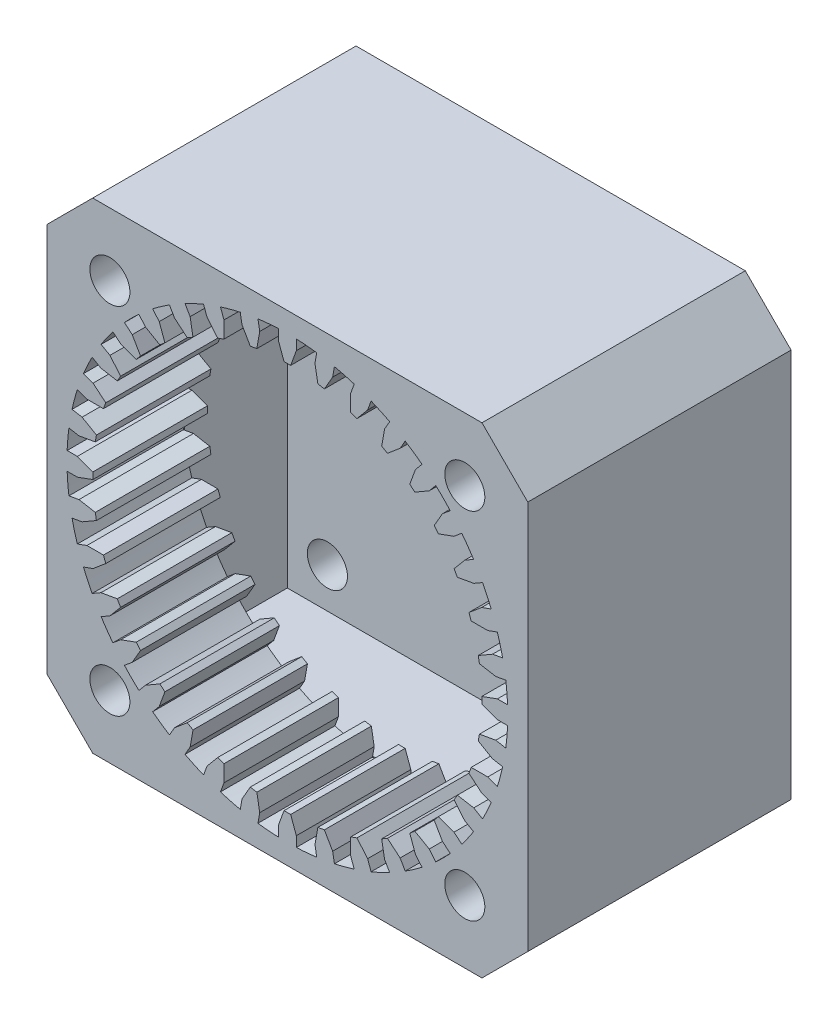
from build123d import *

# Parameters (mm, degrees)
SCHIZZO1_W                   = 42
SCHIZZO1_H                   = 42
ESTRUSIONE_ESTRUSIONE1_DEPTH = 13
SCHIZZO2_W                   = 38
SCHIZZO2_H                   = 38
TAGLIO_ESTRUSIONE1_DEPTH     = 9
SCHIZZO3_R                   = 1.75
TAGLIO_ESTRUSIONE2_DEPTH     = 32.032241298
SCHIZZO4_W                   = 42
SCHIZZO4_H                   = 42
ESTRUSIONE_ESTRUSIONE2_DEPTH = 10
SCHIZZO5_R                   = 2.75
SCHIZZO5_R_2                 = 1.75
TAGLIO_ESTRUSIONE3_DEPTH     = 38.563279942
SCHIZZO7_R                   = 11
TAGLIO_ESTRUSIONE4_DEPTH     = 3
SMUSSO1_SIZE                 = 4


with BuildPart() as part:
    # Schizzo1 → Estrusione-Estrusione1 (new body)
    with BuildSketch(Plane.XY):
        Rectangle(SCHIZZO1_W, SCHIZZO1_H)
    extrude(amount=ESTRUSIONE_ESTRUSIONE1_DEPTH)

    # Schizzo2 → Taglio-Estrusione1 (cut)
    with BuildSketch(Plane.XY.offset(13)):
        Rectangle(SCHIZZO2_W, SCHIZZO2_H)
    extrude(amount=-TAGLIO_ESTRUSIONE1_DEPTH, mode=Mode.SUBTRACT)

    # Schizzo3 → Taglio-Estrusione2 (cut, through all)
    with BuildSketch(Plane.XY.offset(4)):
        with Locations((-15.5, 15.5)):
            Circle(SCHIZZO3_R)
        with Locations((15.5, 15.5)):
            Circle(SCHIZZO3_R)
        with Locations((15.5, -15.5)):
            Circle(SCHIZZO3_R)
        with Locations((-15.5, -15.5)):
            Circle(SCHIZZO3_R)
    extrude(amount=-TAGLIO_ESTRUSIONE2_DEPTH, mode=Mode.SUBTRACT)

    # Schizzo4 → Estrusione-Estrusione2 (add)
    with BuildSketch(Plane.XY.offset(13)):
        Rectangle(SCHIZZO4_W, SCHIZZO4_H)
        with BuildLine():
            Line((19.233987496, 0.785), (18.343987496, 0.785))
            Line((18.343987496, 0.785), (16.983987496, 0.290000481))
            Line((16.983987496, 0.290000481), (16.983987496, -0.290000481))
            Line((16.983987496, -0.290000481), (18.343987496, -0.785))
            Line((18.343987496, -0.785), (19.233987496, -0.785))
            ThreePointArc((19.233987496, -0.785), (19.176747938, -1.677748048), (19.078093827, -2.566872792))
            Line((19.078093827, -2.566872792), (18.201614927, -2.412325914))
            Line((18.201614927, -2.412325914), (16.776320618, -2.663643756))
            Line((16.776320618, -2.663643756), (16.675604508, -3.234833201))
            Line((16.675604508, -3.234833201), (17.928987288, -3.958474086))
            Line((17.928987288, -3.958474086), (18.805466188, -4.113020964))
            ThreePointArc((18.805466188, -4.113020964), (18.594072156, -4.982266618), (18.342521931, -5.840752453))
            Line((18.342521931, -5.840752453), (17.506195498, -5.536354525))
            Line((17.506195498, -5.536354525), (16.058913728, -5.536354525))
            Line((16.058913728, -5.536354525), (15.860541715, -6.08137715))
            Line((15.860541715, -6.08137715), (16.969223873, -7.01167194))
            Line((16.969223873, -7.01167194), (17.805550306, -7.316069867))
            ThreePointArc((17.805550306, -7.316069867), (17.4464249, -8.135401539), (17.049621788, -8.937163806))
            Line((17.049621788, -8.937163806), (16.278859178, -8.492163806))
            Line((16.278859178, -8.492163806), (14.85356487, -8.240845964))
            Line((14.85356487, -8.240845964), (14.563564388, -8.743141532))
            Line((14.563564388, -8.743141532), (15.493859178, -9.85182369))
            Line((15.493859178, -9.85182369), (16.264621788, -10.29682369))
            ThreePointArc((16.264621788, -10.29682369), (15.768676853, -11.0413464), (15.238677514, -11.76202396))
            Line((15.238677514, -11.76202396), (14.55689796, -11.189942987))
            Line((14.55689796, -11.189942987), (13.19689796, -10.694943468))
            Line((13.19689796, -10.694943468), (12.824080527, -11.139249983))
            Line((12.824080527, -11.139249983), (13.547721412, -12.392632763))
            Line((13.547721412, -12.392632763), (14.229500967, -12.964713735))
            ThreePointArc((14.229500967, -12.964713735), (13.611805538, -13.611805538), (12.964713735, -14.229500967))
            Line((12.964713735, -14.229500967), (12.392632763, -13.547721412))
            Line((12.392632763, -13.547721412), (11.139249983, -12.824080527))
            Line((11.139249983, -12.824080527), (10.694943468, -13.19689796))
            Line((10.694943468, -13.19689796), (11.189942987, -14.55689796))
            Line((11.189942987, -14.55689796), (11.76202396, -15.238677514))
            ThreePointArc((11.76202396, -15.238677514), (11.0413464, -15.768676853), (10.29682369, -16.264621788))
            Line((10.29682369, -16.264621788), (9.85182369, -15.493859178))
            Line((9.85182369, -15.493859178), (8.743141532, -14.563564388))
            Line((8.743141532, -14.563564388), (8.240845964, -14.85356487))
            Line((8.240845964, -14.85356487), (8.492163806, -16.278859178))
            Line((8.492163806, -16.278859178), (8.937163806, -17.049621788))
            ThreePointArc((8.937163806, -17.049621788), (8.135401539, -17.4464249), (7.316069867, -17.805550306))
            Line((7.316069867, -17.805550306), (7.01167194, -16.969223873))
            Line((7.01167194, -16.969223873), (6.08137715, -15.860541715))
            Line((6.08137715, -15.860541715), (5.536354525, -16.058913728))
            Line((5.536354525, -16.058913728), (5.536354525, -17.506195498))
            Line((5.536354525, -17.506195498), (5.840752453, -18.342521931))
            ThreePointArc((5.840752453, -18.342521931), (4.982266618, -18.594072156), (4.113020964, -18.805466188))
            Line((4.113020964, -18.805466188), (3.958474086, -17.928987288))
            Line((3.958474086, -17.928987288), (3.234833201, -16.675604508))
            Line((3.234833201, -16.675604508), (2.663643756, -16.776320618))
            Line((2.663643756, -16.776320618), (2.412325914, -18.201614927))
            Line((2.412325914, -18.201614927), (2.566872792, -19.078093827))
            ThreePointArc((2.566872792, -19.078093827), (1.677748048, -19.176747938), (0.785, -19.233987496))
            Line((0.785, -19.233987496), (0.785, -18.343987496))
            Line((0.785, -18.343987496), (0.290000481, -16.983987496))
            Line((0.290000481, -16.983987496), (-0.290000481, -16.983987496))
            Line((-0.290000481, -16.983987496), (-0.785, -18.343987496))
            Line((-0.785, -18.343987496), (-0.785, -19.233987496))
            ThreePointArc((-0.785, -19.233987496), (-1.677748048, -19.176747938), (-2.566872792, -19.078093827))
            Line((-2.566872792, -19.078093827), (-2.412325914, -18.201614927))
            Line((-2.412325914, -18.201614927), (-2.663643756, -16.776320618))
            Line((-2.663643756, -16.776320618), (-3.234833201, -16.675604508))
            Line((-3.234833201, -16.675604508), (-3.958474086, -17.928987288))
            Line((-3.958474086, -17.928987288), (-4.113020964, -18.805466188))
            ThreePointArc((-4.113020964, -18.805466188), (-4.982266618, -18.594072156), (-5.840752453, -18.342521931))
            Line((-5.840752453, -18.342521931), (-5.536354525, -17.506195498))
            Line((-5.536354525, -17.506195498), (-5.536354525, -16.058913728))
            Line((-5.536354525, -16.058913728), (-6.08137715, -15.860541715))
            Line((-6.08137715, -15.860541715), (-7.01167194, -16.969223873))
            Line((-7.01167194, -16.969223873), (-7.316069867, -17.805550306))
            ThreePointArc((-7.316069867, -17.805550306), (-8.135401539, -17.4464249), (-8.937163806, -17.049621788))
            Line((-8.937163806, -17.049621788), (-8.492163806, -16.278859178))
            Line((-8.492163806, -16.278859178), (-8.240845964, -14.85356487))
            Line((-8.240845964, -14.85356487), (-8.743141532, -14.563564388))
            Line((-8.743141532, -14.563564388), (-9.85182369, -15.493859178))
            Line((-9.85182369, -15.493859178), (-10.29682369, -16.264621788))
            ThreePointArc((-10.29682369, -16.264621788), (-11.0413464, -15.768676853), (-11.76202396, -15.238677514))
            Line((-11.76202396, -15.238677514), (-11.189942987, -14.55689796))
            Line((-11.189942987, -14.55689796), (-10.694943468, -13.19689796))
            Line((-10.694943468, -13.19689796), (-11.139249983, -12.824080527))
            Line((-11.139249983, -12.824080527), (-12.392632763, -13.547721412))
            Line((-12.392632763, -13.547721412), (-12.964713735, -14.229500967))
            ThreePointArc((-12.964713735, -14.229500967), (-13.611805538, -13.611805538), (-14.229500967, -12.964713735))
            Line((-14.229500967, -12.964713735), (-13.547721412, -12.392632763))
            Line((-13.547721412, -12.392632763), (-12.824080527, -11.139249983))
            Line((-12.824080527, -11.139249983), (-13.19689796, -10.694943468))
            Line((-13.19689796, -10.694943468), (-14.55689796, -11.189942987))
            Line((-14.55689796, -11.189942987), (-15.238677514, -11.76202396))
            ThreePointArc((-15.238677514, -11.76202396), (-15.768676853, -11.0413464), (-16.264621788, -10.29682369))
            Line((-16.264621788, -10.29682369), (-15.493859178, -9.85182369))
            Line((-15.493859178, -9.85182369), (-14.563564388, -8.743141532))
            Line((-14.563564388, -8.743141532), (-14.85356487, -8.240845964))
            Line((-14.85356487, -8.240845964), (-16.278859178, -8.492163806))
            Line((-16.278859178, -8.492163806), (-17.049621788, -8.937163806))
            ThreePointArc((-17.049621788, -8.937163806), (-17.4464249, -8.135401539), (-17.805550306, -7.316069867))
            Line((-17.805550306, -7.316069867), (-16.969223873, -7.01167194))
            Line((-16.969223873, -7.01167194), (-15.860541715, -6.08137715))
            Line((-15.860541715, -6.08137715), (-16.058913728, -5.536354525))
            Line((-16.058913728, -5.536354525), (-17.506195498, -5.536354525))
            Line((-17.506195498, -5.536354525), (-18.342521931, -5.840752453))
            ThreePointArc((-18.342521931, -5.840752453), (-18.594072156, -4.982266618), (-18.805466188, -4.113020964))
            Line((-18.805466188, -4.113020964), (-17.928987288, -3.958474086))
            Line((-17.928987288, -3.958474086), (-16.675604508, -3.234833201))
            Line((-16.675604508, -3.234833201), (-16.776320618, -2.663643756))
            Line((-16.776320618, -2.663643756), (-18.201614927, -2.412325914))
            Line((-18.201614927, -2.412325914), (-19.078093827, -2.566872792))
            ThreePointArc((-19.078093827, -2.566872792), (-19.176747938, -1.677748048), (-19.233987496, -0.785))
            Line((-19.233987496, -0.785), (-18.343987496, -0.785))
            Line((-18.343987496, -0.785), (-16.983987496, -0.290000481))
            Line((-16.983987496, -0.290000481), (-16.983987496, 0.290000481))
            Line((-16.983987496, 0.290000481), (-18.343987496, 0.785))
            Line((-18.343987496, 0.785), (-19.233987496, 0.785))
            ThreePointArc((-19.233987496, 0.785), (-19.176747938, 1.677748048), (-19.078093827, 2.566872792))
            Line((-19.078093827, 2.566872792), (-18.201614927, 2.412325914))
            Line((-18.201614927, 2.412325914), (-16.776320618, 2.663643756))
            Line((-16.776320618, 2.663643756), (-16.675604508, 3.234833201))
            Line((-16.675604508, 3.234833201), (-17.928987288, 3.958474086))
            Line((-17.928987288, 3.958474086), (-18.805466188, 4.113020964))
            ThreePointArc((-18.805466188, 4.113020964), (-18.594072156, 4.982266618), (-18.342521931, 5.840752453))
            Line((-18.342521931, 5.840752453), (-17.506195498, 5.536354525))
            Line((-17.506195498, 5.536354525), (-16.058913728, 5.536354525))
            Line((-16.058913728, 5.536354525), (-15.860541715, 6.08137715))
            Line((-15.860541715, 6.08137715), (-16.969223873, 7.01167194))
            Line((-16.969223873, 7.01167194), (-17.805550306, 7.316069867))
            ThreePointArc((-17.805550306, 7.316069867), (-17.4464249, 8.135401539), (-17.049621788, 8.937163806))
            Line((-17.049621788, 8.937163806), (-16.278859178, 8.492163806))
            Line((-16.278859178, 8.492163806), (-14.85356487, 8.240845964))
            Line((-14.85356487, 8.240845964), (-14.563564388, 8.743141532))
            Line((-14.563564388, 8.743141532), (-15.493859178, 9.85182369))
            Line((-15.493859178, 9.85182369), (-16.264621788, 10.29682369))
            ThreePointArc((-16.264621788, 10.29682369), (-15.768676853, 11.0413464), (-15.238677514, 11.76202396))
            Line((-15.238677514, 11.76202396), (-14.55689796, 11.189942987))
            Line((-14.55689796, 11.189942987), (-13.19689796, 10.694943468))
            Line((-13.19689796, 10.694943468), (-12.824080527, 11.139249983))
            Line((-12.824080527, 11.139249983), (-13.547721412, 12.392632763))
            Line((-13.547721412, 12.392632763), (-14.229500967, 12.964713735))
            ThreePointArc((-14.229500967, 12.964713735), (-13.611805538, 13.611805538), (-12.964713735, 14.229500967))
            Line((-12.964713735, 14.229500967), (-12.392632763, 13.547721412))
            Line((-12.392632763, 13.547721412), (-11.139249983, 12.824080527))
            Line((-11.139249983, 12.824080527), (-10.694943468, 13.19689796))
            Line((-10.694943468, 13.19689796), (-11.189942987, 14.55689796))
            Line((-11.189942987, 14.55689796), (-11.76202396, 15.238677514))
            ThreePointArc((-11.76202396, 15.238677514), (-11.0413464, 15.768676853), (-10.29682369, 16.264621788))
            Line((-10.29682369, 16.264621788), (-9.85182369, 15.493859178))
            Line((-9.85182369, 15.493859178), (-8.743141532, 14.563564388))
            Line((-8.743141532, 14.563564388), (-8.240845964, 14.85356487))
            Line((-8.240845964, 14.85356487), (-8.492163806, 16.278859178))
            Line((-8.492163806, 16.278859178), (-8.937163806, 17.049621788))
            ThreePointArc((-8.937163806, 17.049621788), (-8.135401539, 17.4464249), (-7.316069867, 17.805550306))
            Line((-7.316069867, 17.805550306), (-7.01167194, 16.969223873))
            Line((-7.01167194, 16.969223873), (-6.08137715, 15.860541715))
            Line((-6.08137715, 15.860541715), (-5.536354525, 16.058913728))
            Line((-5.536354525, 16.058913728), (-5.536354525, 17.506195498))
            Line((-5.536354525, 17.506195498), (-5.840752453, 18.342521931))
            ThreePointArc((-5.840752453, 18.342521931), (-4.982266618, 18.594072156), (-4.113020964, 18.805466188))
            Line((-4.113020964, 18.805466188), (-3.958474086, 17.928987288))
            Line((-3.958474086, 17.928987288), (-3.234833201, 16.675604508))
            Line((-3.234833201, 16.675604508), (-2.663643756, 16.776320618))
            Line((-2.663643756, 16.776320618), (-2.412325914, 18.201614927))
            Line((-2.412325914, 18.201614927), (-2.566872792, 19.078093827))
            ThreePointArc((-2.566872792, 19.078093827), (-1.677748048, 19.176747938), (-0.785, 19.233987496))
            Line((-0.785, 19.233987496), (-0.785, 18.343987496))
            Line((-0.785, 18.343987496), (-0.290000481, 16.983987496))
            Line((-0.290000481, 16.983987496), (0.290000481, 16.983987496))
            Line((0.290000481, 16.983987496), (0.785, 18.343987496))
            Line((0.785, 18.343987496), (0.785, 19.233987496))
            ThreePointArc((0.785, 19.233987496), (1.677748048, 19.176747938), (2.566872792, 19.078093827))
            Line((2.566872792, 19.078093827), (2.412325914, 18.201614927))
            Line((2.412325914, 18.201614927), (2.663643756, 16.776320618))
            Line((2.663643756, 16.776320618), (3.234833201, 16.675604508))
            Line((3.234833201, 16.675604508), (3.958474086, 17.928987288))
            Line((3.958474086, 17.928987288), (4.113020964, 18.805466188))
            ThreePointArc((4.113020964, 18.805466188), (4.982266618, 18.594072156), (5.840752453, 18.342521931))
            Line((5.840752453, 18.342521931), (5.536354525, 17.506195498))
            Line((5.536354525, 17.506195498), (5.536354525, 16.058913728))
            Line((5.536354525, 16.058913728), (6.08137715, 15.860541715))
            Line((6.08137715, 15.860541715), (7.01167194, 16.969223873))
            Line((7.01167194, 16.969223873), (7.316069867, 17.805550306))
            ThreePointArc((7.316069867, 17.805550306), (8.135401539, 17.4464249), (8.937163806, 17.049621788))
            Line((8.937163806, 17.049621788), (8.492163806, 16.278859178))
            Line((8.492163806, 16.278859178), (8.240845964, 14.85356487))
            Line((8.240845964, 14.85356487), (8.743141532, 14.563564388))
            Line((8.743141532, 14.563564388), (9.85182369, 15.493859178))
            Line((9.85182369, 15.493859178), (10.29682369, 16.264621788))
            ThreePointArc((10.29682369, 16.264621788), (11.0413464, 15.768676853), (11.76202396, 15.238677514))
            Line((11.76202396, 15.238677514), (11.189942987, 14.55689796))
            Line((11.189942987, 14.55689796), (10.694943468, 13.19689796))
            Line((10.694943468, 13.19689796), (11.139249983, 12.824080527))
            Line((11.139249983, 12.824080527), (12.392632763, 13.547721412))
            Line((12.392632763, 13.547721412), (12.964713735, 14.229500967))
            ThreePointArc((12.964713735, 14.229500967), (13.611805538, 13.611805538), (14.229500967, 12.964713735))
            Line((14.229500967, 12.964713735), (13.547721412, 12.392632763))
            Line((13.547721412, 12.392632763), (12.824080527, 11.139249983))
            Line((12.824080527, 11.139249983), (13.19689796, 10.694943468))
            Line((13.19689796, 10.694943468), (14.55689796, 11.189942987))
            Line((14.55689796, 11.189942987), (15.238677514, 11.76202396))
            ThreePointArc((15.238677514, 11.76202396), (15.768676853, 11.0413464), (16.264621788, 10.29682369))
            Line((16.264621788, 10.29682369), (15.493859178, 9.85182369))
            Line((15.493859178, 9.85182369), (14.563564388, 8.743141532))
            Line((14.563564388, 8.743141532), (14.85356487, 8.240845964))
            Line((14.85356487, 8.240845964), (16.278859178, 8.492163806))
            Line((16.278859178, 8.492163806), (17.049621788, 8.937163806))
            ThreePointArc((17.049621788, 8.937163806), (17.4464249, 8.135401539), (17.805550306, 7.316069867))
            Line((17.805550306, 7.316069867), (16.969223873, 7.01167194))
            Line((16.969223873, 7.01167194), (15.860541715, 6.08137715))
            Line((15.860541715, 6.08137715), (16.058913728, 5.536354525))
            Line((16.058913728, 5.536354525), (17.506195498, 5.536354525))
            Line((17.506195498, 5.536354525), (18.342521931, 5.840752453))
            ThreePointArc((18.342521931, 5.840752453), (18.594072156, 4.982266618), (18.805466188, 4.113020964))
            Line((18.805466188, 4.113020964), (17.928987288, 3.958474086))
            Line((17.928987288, 3.958474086), (16.675604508, 3.234833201))
            Line((16.675604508, 3.234833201), (16.776320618, 2.663643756))
            Line((16.776320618, 2.663643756), (18.201614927, 2.412325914))
            Line((18.201614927, 2.412325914), (19.078093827, 2.566872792))
            ThreePointArc((19.078093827, 2.566872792), (19.176747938, 1.677748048), (19.233987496, 0.785))
        make_face(mode=Mode.SUBTRACT)
    extrude(amount=ESTRUSIONE_ESTRUSIONE2_DEPTH)

    # Schizzo5 → Taglio-Estrusione3 (cut, through all)
    with BuildSketch(Plane(origin=(0, 0, 0), x_dir=(-1, 0, 0), z_dir=(0, 0, -1))):
        Circle(SCHIZZO5_R)
        with Locations(Location((15.5, -15.5, 0), (0, 0, 180))):
            Circle(SCHIZZO5_R_2)
        with Locations(Location((-15.5, -15.5, 0), (0, 0, 180))):
            Circle(SCHIZZO5_R_2)
        with Locations(Location((-15.5, 15.5, 0), (0, 0, 180))):
            Circle(SCHIZZO5_R_2)
        with Locations(Location((15.5, 15.5, 0), (0, 0, 180))):
            Circle(SCHIZZO5_R_2)
    extrude(amount=-TAGLIO_ESTRUSIONE3_DEPTH, mode=Mode.SUBTRACT)

    # Schizzo7 → Taglio-Estrusione4 (cut)
    with BuildSketch(Plane(origin=(0, 0, 0), x_dir=(-1, 0, 0), z_dir=(0, 0, -1))):
        Circle(SCHIZZO7_R)
    extrude(amount=-TAGLIO_ESTRUSIONE4_DEPTH, mode=Mode.SUBTRACT)

    # Smusso1
    smusso1_edges = [part.edges().sort_by_distance(p)[0] for p in [
        (-21, 21, 11.5),
        (21, 21, 11.5),
        (21, -21, 11.5),
        (-21, -21, 11.5),
    ]]
    chamfer(smusso1_edges, length=SMUSSO1_SIZE)


solid = part.part
